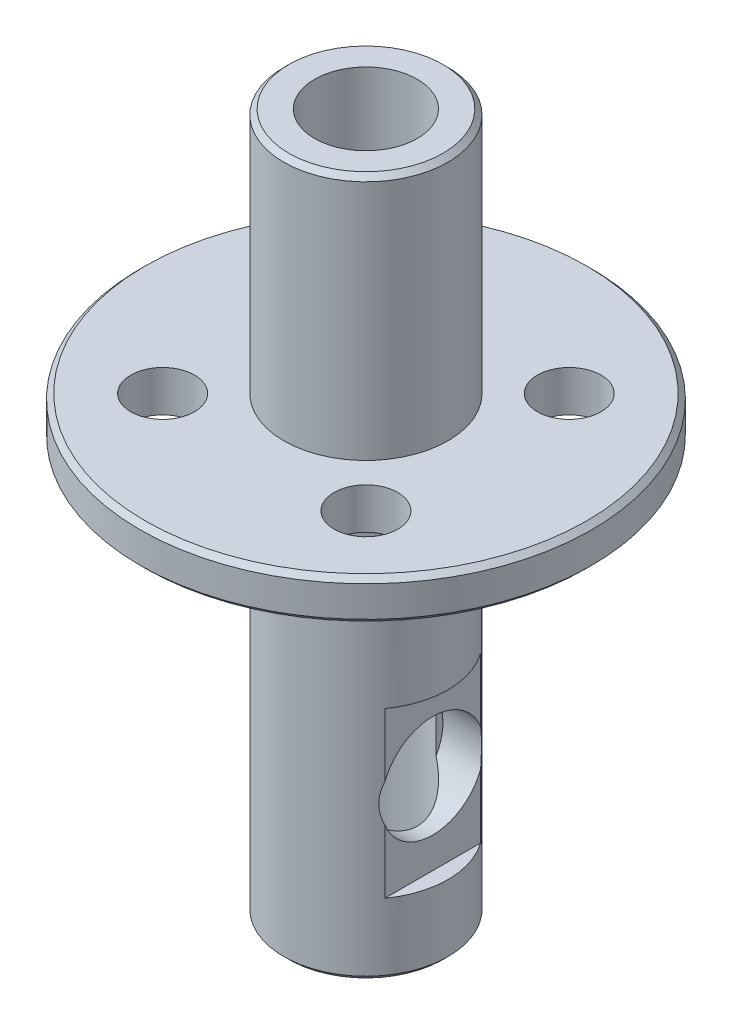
from build123d import *

# Parameters (mm, degrees)
SKETCH2_R           = 11
BOSS_EXTRUDE1_DEPTH = 2
SKETCH3_R           = 4
BOSS_EXTRUDE2_DEPTH = 12
BOSS_EXTRUDE3_START = 20
SKETCH4_R           = 4
BOSS_EXTRUDE3_DEPTH = 20
SKETCH5_R           = 2.5
CUT_EXTRUDE1_DEPTH  = 38.389838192
SKETCH7_W           = 5
SKETCH7_H           = 8
CUT_EXTRUDE2_DEPTH  = 0.75
SKETCH8_R           = 2.5
CUT_EXTRUDE3_DEPTH  = 2
SKETCH9_R           = 1.55
CUT_EXTRUDE5_DEPTH  = 27.944387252
CHAMFER1_SIZE       = 0.25


with BuildPart() as part:
    # Sketch2 → Boss-Extrude1 (new body)
    with BuildSketch(Plane(origin=(0, 0, 0), x_dir=(1, 0, 0), z_dir=(0, 1, 0))):
        with Locations(Location((0, 0, 0), (0, 0, 270))):
            Circle(SKETCH2_R)
    extrude(amount=BOSS_EXTRUDE1_DEPTH)

    # Sketch3 → Boss-Extrude2 (add)
    with BuildSketch(Plane(origin=(0, 2, 0), x_dir=(1, 0, 0), z_dir=(0, 1, 0))):
        with Locations(Location((0, 0, 0), (0, 0, 270))):
            Circle(SKETCH3_R)
    extrude(amount=BOSS_EXTRUDE2_DEPTH)

    # Sketch4 → Boss-Extrude3 (add)
    with BuildSketch(Plane.XZ.offset(BOSS_EXTRUDE3_START)):
        with Locations(Location((0, 0, 0), (0, 0, 90))):
            Circle(SKETCH4_R)
    extrude(amount=-BOSS_EXTRUDE3_DEPTH)

    # Sketch5 → Cut-Extrude1 (cut, through all)
    with BuildSketch(Plane(origin=(0, 14, 0), x_dir=(1, 0, 0), z_dir=(0, 1, 0))):
        with Locations(Location((0, 0, 0), (0, 0, 270))):
            Circle(SKETCH5_R)
    extrude(amount=-CUT_EXTRUDE1_DEPTH, mode=Mode.SUBTRACT)

    # Sketch7 → Cut-Extrude2 (cut)
    with BuildSketch(Plane(origin=(4, 0, 0), x_dir=(0, 0, -1), z_dir=(1, 0, 0))):
        with Locations((0, -12.5)):
            Rectangle(SKETCH7_W, SKETCH7_H)
    extrude(amount=-CUT_EXTRUDE2_DEPTH, mode=Mode.SUBTRACT)

    # Sketch8 → Cut-Extrude3 (cut)
    with BuildSketch(Plane(origin=(3.25, 0, 0), x_dir=(0, 0, -1), z_dir=(1, 0, 0))):
        with Locations(Location((0, -12.5, 0), (0, 0, 21.134292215))):
            Circle(SKETCH8_R)
    extrude(amount=-CUT_EXTRUDE3_DEPTH, mode=Mode.SUBTRACT)

    # Sketch9 → Cut-Extrude5 (cut, through all)
    with BuildSketch(Plane(origin=(0, 2, 0), x_dir=(1, 0, 0), z_dir=(0, 1, 0))):
        with Locations(Location((4.949747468, 4.949747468, 0), (0, 0, 270))):
            Circle(SKETCH9_R)
        with Locations(Location((4.949747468, -4.949747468, 0), (0, 0, 270))):
            Circle(SKETCH9_R)
        with Locations(Location((-4.949747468, -4.949747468, 0), (0, 0, 270))):
            Circle(SKETCH9_R)
        with Locations(Location((-4.949747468, 4.949747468, 0), (0, 0, 270))):
            Circle(SKETCH9_R)
    extrude(amount=-CUT_EXTRUDE5_DEPTH, mode=Mode.SUBTRACT)

    # Chamfer1
    chamfer1_edges = [part.edges().sort_by_distance(p)[0] for p in [
        (0, -20, -4),
        (0, 0, -11),
        (0, 2, -11),
        (0, 14, -4),
    ]]
    chamfer(chamfer1_edges, length=CHAMFER1_SIZE)


solid = part.part
